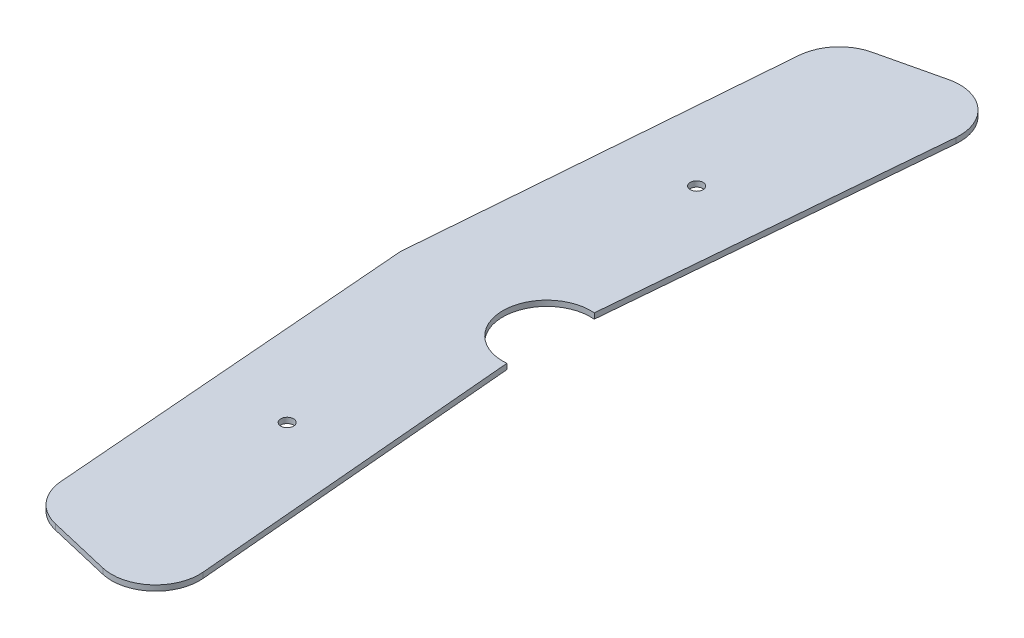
from build123d import *

# Parameters (mm, degrees)
SKETCH1_R      = 1.75
EXTRUDE1_DEPTH = 1.5


with BuildPart() as part:
    # Sketch1 → Extrude1 (new body)
    with BuildSketch(Plane(origin=(0, 0, 0), x_dir=(1, 0, 0), z_dir=(0, 1, 0))):
        with BuildLine():
            Line((41.039753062, 11.954869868), (48.954780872, 102.960254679))
            ThreePointArc((48.954780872, 102.960254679), (44.851330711, 113.074935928), (34.251621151, 115.680936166))
            Line((34.251621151, 115.680936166), (17.251596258, 111.681041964))
            ThreePointArc((17.251596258, 111.681041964), (10.89637525, 107.818214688), (8.037836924, 100.95242797))
            Line((8.037836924, 100.95242797), (0, 0))
            Line((0, 0), (8.037836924, -100.95242797))
            ThreePointArc((8.037836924, -100.95242797), (10.89637525, -107.818214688), (17.251596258, -111.681041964))
            Line((17.251596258, -111.681041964), (34.251621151, -115.680936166))
            ThreePointArc((34.251621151, -115.680936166), (44.851330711, -113.074935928), (48.954780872, -102.960254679))
            Line((48.954780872, -102.960254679), (41.039753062, -11.954869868))
            ThreePointArc((41.039753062, -11.954869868), (28, 0), (41.039753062, 11.954869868))
        make_face()
        with Locations(Location((25, 56, 0), (0, 0, 270))):
            Circle(SKETCH1_R, mode=Mode.SUBTRACT)
        with Locations(Location((25, -56, 0), (0, 0, 90))):
            Circle(SKETCH1_R, mode=Mode.SUBTRACT)
    extrude(amount=EXTRUDE1_DEPTH)


solid = part.part
